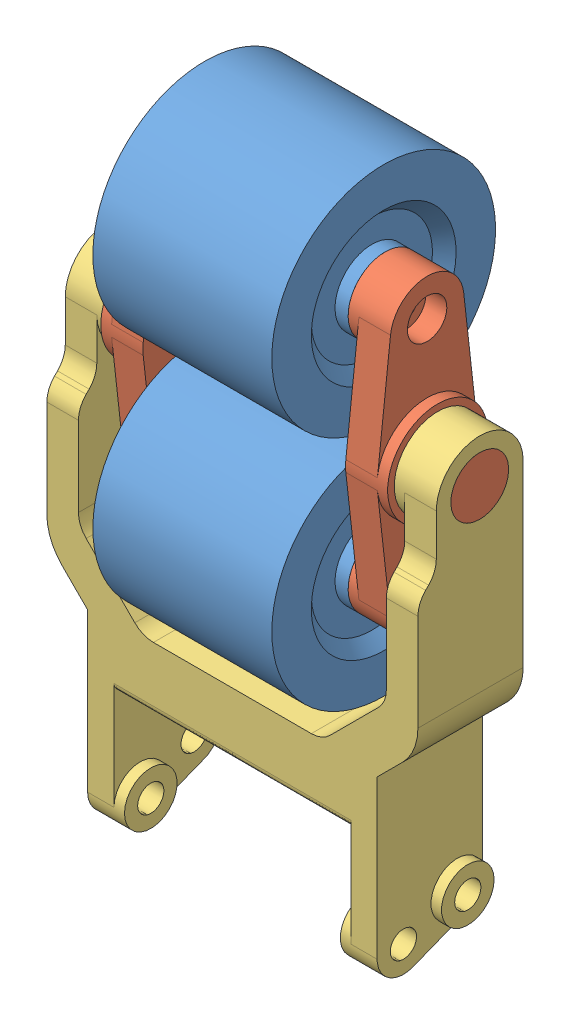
SolidWorks assembly chape+bogie.SLDASM, configuration Eclaté (file format 3100). Lengths in mm.
Overall size (141 262.28 111.02).
7 component instances, 4 part files, 16 mates.
Components (placement in the parent):
- 1-Rouleau-1: 1-Rouleau.SLDPRT [Défaut] at (0 135.2954 -33.0288) x (-1 0 0) z (0 0.381849 -0.924225) size (69 85 85)
- 1-Rouleau-2: 1-Rouleau.SLDPRT [Défaut] at (0 225.2954 -33.0288) x (-1 0 0) z (0 0.381849 -0.924225) size (69 85 85)
- 2-levier-1: 2-levier.SLDPRT [Défaut] at (-50.5 180.2954 -33.0288) x (0 1 0) z (1 0 0) size (118 38 36)
- 2-levier-2: 2-levier.SLDPRT [Défaut] at (50.5 180.2954 -33.0288) x (0 -1 0) z (-1 0 0) size (118 38 36)
- 3-Chape-1: 3-Chape.SLDPRT [Défaut] at (0 90.2954 -29.5288) size (141 178.27 40.46)
- Axe de galet-1: Axe de galet.SLDPRT [Défaut] at (42.5 180.2954 -33.0288) x (0 1 0) z (1 0 0) size (8 8 85)
- Axe de galet-2: Axe de galet.SLDPRT [Défaut] at (-42.5 135.2954 -78.0288) x (0 0 1) z (-1 0 0) size (8 8 85)
Mates (geometry in assembly coordinates):
- Coaxial1: concentric aligned: cylinder of 2-levier-1; cylinder of 3-Chape-1
- Coïncidente1: coincident anti-aligned: plane of 2-levier-1 through (-54.5 180.2954 -33.0288) normal (-1 0 0); plane of 3-Chape-1 through (-54.5 180.2954 -33.0288) normal (1 0 0)
- Coïncidente2: coincident anti-aligned: plane of 2-levier-2 through (54.5 180.2954 -33.0288) normal (1 0 0); plane of 3-Chape-1 through (54.5 180.2954 -33.0288) normal (-1 0 0)
- Coaxial2: concentric anti-aligned: cylinder of 2-levier-2; cylinder of 3-Chape-1
- Coaxial3: concentric anti-aligned: cylinder of 1-Rouleau-2; cylinder of 2-levier-2
- Coaxial4: concentric aligned: cylinder of 1-Rouleau-2; cylinder of 2-levier-1
- Coïncidente4: coincident anti-aligned: plane of 1-Rouleau-1 through (-34.5 138.9923 -31.5014) normal (-1 0 0); plane of 2-levier-1 through (-34.5 135.2954 -33.0288) normal (1 0 0)
- Coaxial5: concentric aligned: cylinder of 1-Rouleau-1; cylinder of 2-levier-1
- Perpendiculaire1: perpendicular: plane of 2-levier-2 through (34.5 213.1161 -26.1249) normal (0 -1 0); plane of 3-Chape-1 through (48.5 118.7954 -9.5288) normal (0 0 1)
- Coïncidente6: coincident anti-aligned: plane of 1-Rouleau-2 through (34.5 228.9923 -31.5014) normal (1 0 0); plane of 2-levier-2 through (34.5 225.2954 -33.0288) normal (-1 0 0)
- Sur place1: in place: plane of 2-levier-2 through (42.5 225.2954 -33.0288) normal (1 0 0); plane of Axe de galet-1; moOrthogonalPlaneRef_w of 2-levier-2; plane of Axe de galet-1; moOrthogonalPlaneRef_w of 2-levier-2; plane of Axe de galet-1
- Coïncidente10: coincident aligned: plane of 2-levier-2; plane of Axe de galet-1
- Coïncidente11: coincident aligned: moOrthogonalPlaneRef_w of 2-levier-2; plane of Axe de galet-1
- Coïncidente12: coincident anti-aligned: moOrthogonalPlaneRef_w of 2-levier-2; plane of Axe de galet-1
- Coaxial12: concentric anti-aligned: cylinder of 2-levier-1; cylinder of Axe de galet-2
- Coïncidente14: coincident aligned: unknown of 2-levier-1; unknown of Axe de galet-2
